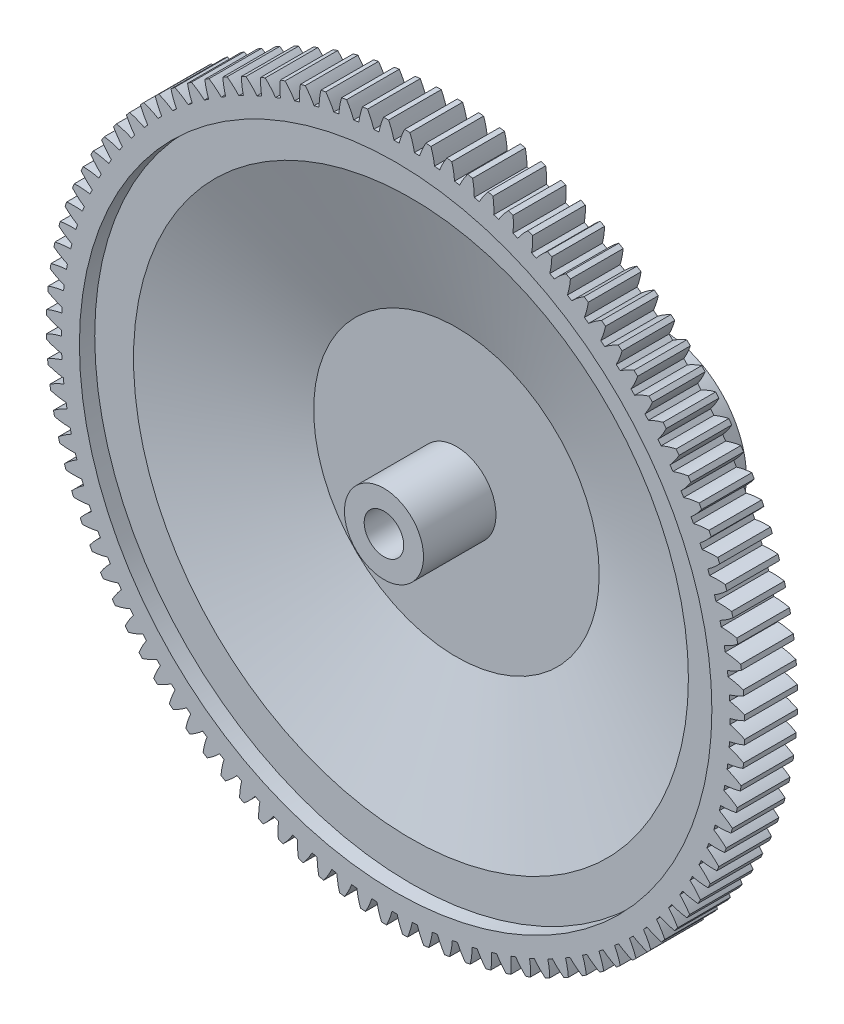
from build123d import *

# Parameters (mm, degrees)
ESQUISSE1_R                  = 3
ESQUISSE1_R_2                = 1.5
BASE_EXTRUSION_DEPTH         = 18.5
ESQUISSE4_R                  = 6.5
BOSS_EXTRU_1_DEPTH           = 11
ENL_V_START                  = -5
ENL_V_MAT_EXTRU_1_DEPTH      = 5
R_P_TITION_CIRCULAIRE1_COUNT = 104
R_P_TITION_CIRCULAIRE1_ANGLE = 356.498862


with BuildPart() as part:
    # Esquisse1 → Base-Extrusion (new body)
    with BuildSketch(Plane.XY):
        Circle(ESQUISSE1_R)
        Circle(ESQUISSE1_R_2, mode=Mode.SUBTRACT)
    extrude(amount=BASE_EXTRUSION_DEPTH)

    # Esquisse3 → Boss.-R_vol.2 (revolve)
    with BuildSketch(Plane(origin=(0, 0, 0), x_dir=(1, 0, 0), z_dir=(0, 1, 0))):
        Polygon((3, -12), (11, -12), (20.220113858, -15.114221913), (24, -15.114221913), (24, -13.614221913), (26.5, -13.614221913), (26.5, -17.614221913), (24, -17.614221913), (24, -16.451985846), (21.055791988, -16.451985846), (10.83567813, -13), (3, -13), align=None)
    revolve(axis=Axis((0, 0, 19), (0, 0, -1)))

    # Esquisse4 → Boss.-Extru.1 (add)
    with BuildSketch(Plane(origin=(0, 0, 12), x_dir=(-1, 0, 0), z_dir=(0, 0, -1))):
        with Locations(Location((-3.5, 0, 0), (0, 0, 0.000294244))):
            Circle(ESQUISSE4_R)
        with BuildLine():
            ThreePointArc((1.25, 1.5612495), (-8.5, 0), (1.25, -1.5612495))
            ThreePointArc((1.25, -1.5612495), (2, 0), (1.25, 1.5612495))
        make_face(mode=Mode.SUBTRACT)
    extrude(amount=BOSS_EXTRU_1_DEPTH)

    # Esquisse5 → Enl_v. mat.-Extru.1 (cut)
    with BuildSketch(Plane(origin=(0, 0, 13.614221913), x_dir=(-1, 0, 0), z_dir=(0, 0, -1)).offset(ENL_V_START)):
        with BuildLine():
            ThreePointArc((0.125686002, 25.374688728), (-0.071040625, 25.374900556), (-0.267762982, 25.373587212))
            ThreePointArc((-0.267762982, 25.373587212), (-0.445690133, 25.943700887), (-0.684384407, 26.491161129))
            ThreePointArc((-0.684384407, 26.491161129), (-0.07419021, 26.499896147), (0.536043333, 26.49457789))
            ThreePointArc((0.536043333, 26.49457789), (0.30041816, 25.945789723), (0.125686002, 25.374688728))
        make_face()
    enl_v_mat_extru_1 = extrude(amount=ENL_V_MAT_EXTRU_1_DEPTH, mode=Mode.SUBTRACT)

    # R_p_tition circulaire1: Enl_v. mat.-Extru.1 ×104 about axis
    r_p_tition_circulaire1_axis = Axis((0, 0, 0), (0, 0, 1))
    for i in range(1, R_P_TITION_CIRCULAIRE1_COUNT):
        add(enl_v_mat_extru_1.rotate(r_p_tition_circulaire1_axis, i * R_P_TITION_CIRCULAIRE1_ANGLE / (R_P_TITION_CIRCULAIRE1_COUNT - 1)), mode=Mode.SUBTRACT)


solid = part.part
